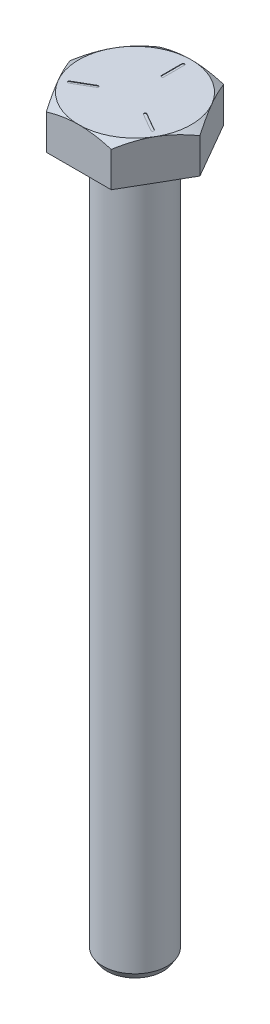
from build123d import *

# Parameters (mm, degrees)
BOSS_EXTRUDE1_DEPTH = 3.9624
CUT_EXTRUDE1_DEPTH  = 0.0508


with BuildPart() as part:
    # Sketch1 → Boss-Extrude1 (new body)
    with BuildSketch(Plane(origin=(0, 0, 0), x_dir=(1, 0, 0), z_dir=(0, 1, 0))):
        Polygon((6.415804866, 0), (3.207902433, 5.55625), (-3.207902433, 5.55625), (-6.415804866, 0), (-3.207902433, -5.55625), (3.207902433, -5.55625), align=None)
    extrude(amount=BOSS_EXTRUDE1_DEPTH)

    # Sketch2 → Cut-Revolve1 (revolve, cut)
    with BuildSketch(Plane.XY):
        Polygon((5.55625, 3.9624), (6.415804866, 3.4544), (6.415804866, 3.9624), align=None)
    revolve(axis=Axis((0, 0, 0), (0, 1, 0)), mode=Mode.SUBTRACT)

    # Sketch3 → Cut-Extrude1 (cut)
    with BuildSketch(Plane(origin=(0, 3.9624, 0), x_dir=(-1, 0, 0), z_dir=(0, -1, 0))):
        with BuildLine():
            Line((0.127, 4.7625), (0.127, 2.7305))
            ThreePointArc((0.127, 2.7305), (0, 2.6035), (-0.127, 2.7305))
            Line((-0.127, 2.7305), (-0.127, 4.7625))
            ThreePointArc((-0.127, 4.7625), (0, 4.8895), (0.127, 4.7625))
        make_face()
        with BuildLine():
            Line((4.060945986, -2.491235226), (2.301182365, -1.475235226))
            ThreePointArc((2.301182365, -1.475235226), (2.254697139, -1.30175), (2.428182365, -1.255264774))
            Line((2.428182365, -1.255264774), (4.187945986, -2.271264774))
            ThreePointArc((4.187945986, -2.271264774), (4.234431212, -2.44475), (4.060945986, -2.491235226))
        make_face()
        with BuildLine():
            Line((-4.187945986, -2.271264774), (-2.428182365, -1.255264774))
            ThreePointArc((-2.428182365, -1.255264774), (-2.254697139, -1.30175), (-2.301182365, -1.475235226))
            Line((-2.301182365, -1.475235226), (-4.060945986, -2.491235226))
            ThreePointArc((-4.060945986, -2.491235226), (-4.234431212, -2.44475), (-4.187945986, -2.271264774))
        make_face()
    extrude(amount=CUT_EXTRUDE1_DEPTH, mode=Mode.SUBTRACT)

    # Bolt Length Sketch → Bolt Length (revolve)
    with BuildSketch(Plane.XY, mode=Mode.PRIVATE) as bolt_length_sk:
        Polygon((0, 0), (0, -69.85), (2.778125, -69.85), (3.175, -69.215), (3.175, 0), align=None)
    revolve(bolt_length_sk.sketch.rotate(Axis((0, 0, 0), (0, -1, 0)), 180), axis=Axis((0, 0, 0), (0, -1, 0)))


solid = part.part
